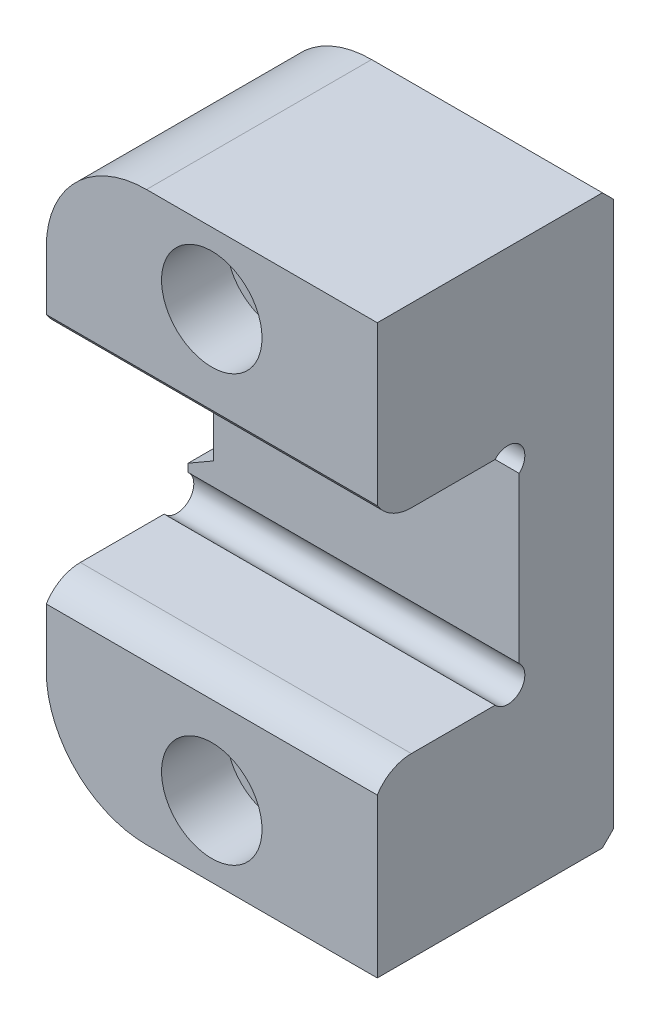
ISO-10303-21;
HEADER;
FILE_DESCRIPTION(('STEP AP214'),'2;1');
FILE_NAME('part.step','',(''),(''),'','','');
FILE_SCHEMA(('AUTOMOTIVE_DESIGN { 1 0 10303 214 1 1 1 1 }'));
ENDSEC;
DATA;
#1=APPLICATION_CONTEXT('core data for automotive mechanical design processes');
#2=APPLICATION_PROTOCOL_DEFINITION('international standard','automotive_design',2000,#1);
#3=PRODUCT_CONTEXT('',#1,'mechanical');
#4=PRODUCT('Part','Part','',(#3));
#5=PRODUCT_RELATED_PRODUCT_CATEGORY('part','',(#4));
#6=PRODUCT_DEFINITION_FORMATION('','',#4);
#7=PRODUCT_DEFINITION_CONTEXT('part definition',#1,'design');
#8=PRODUCT_DEFINITION('design','',#6,#7);
#9=PRODUCT_DEFINITION_SHAPE('','',#8);
#10=(LENGTH_UNIT() NAMED_UNIT(*) SI_UNIT(.MILLI.,.METRE.));
#11=(NAMED_UNIT(*) PLANE_ANGLE_UNIT() SI_UNIT($,.RADIAN.));
#12=(NAMED_UNIT(*) SI_UNIT($,.STERADIAN.) SOLID_ANGLE_UNIT());
#13=UNCERTAINTY_MEASURE_WITH_UNIT(LENGTH_MEASURE(1.E-05),#10,'distance_accuracy_value','');
#14=(GEOMETRIC_REPRESENTATION_CONTEXT(3) GLOBAL_UNCERTAINTY_ASSIGNED_CONTEXT((#13)) GLOBAL_UNIT_ASSIGNED_CONTEXT((#10,
#11,#12)) REPRESENTATION_CONTEXT('',''));
#15=CARTESIAN_POINT('',(0.,0.,0.));
#16=DIRECTION('',(0.,0.,1.));
#17=DIRECTION('',(1.,0.,0.));
#18=AXIS2_PLACEMENT_3D('',#15,#16,#17);
#19=CARTESIAN_POINT('',(22.225,14.2875,-19.05));
#20=DIRECTION('',(0.,0.,-1.));
#21=DIRECTION('',(-1.,0.,0.));
#22=AXIS2_PLACEMENT_3D('',#19,#20,#21);
#23=PLANE('',#22);
#24=DIRECTION('',(-0.866025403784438,0.500000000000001,0.));
#25=VECTOR('',#24,1.);
#26=CARTESIAN_POINT('',(9.24871450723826,-8.18808576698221,-19.05));
#27=LINE('',#26,#25);
#28=CARTESIAN_POINT('',(-18.8228635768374,8.01904739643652,-19.05));
#29=VERTEX_POINT('',#28);
#30=CARTESIAN_POINT('',(-22.225,9.98327177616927,-19.05));
#31=VERTEX_POINT('',#30);
#32=EDGE_CURVE('E340',#29,#31,#27,.T.);
#33=ORIENTED_EDGE('',*,*,#32,.F.);
#34=DIRECTION('',(0.,-1.,0.));
#35=VECTOR('',#34,1.);
#36=CARTESIAN_POINT('',(-18.8228635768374,-8.60845644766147,-19.05));
#37=LINE('',#36,#35);
#38=CARTESIAN_POINT('',(-18.8228635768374,-8.01904739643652,-19.05));
#39=VERTEX_POINT('',#38);
#40=EDGE_CURVE('E255',#29,#39,#37,.T.);
#41=ORIENTED_EDGE('',*,*,#40,.T.);
#42=DIRECTION('',(0.866025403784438,0.500000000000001,0.));
#43=VECTOR('',#42,1.);
#44=CARTESIAN_POINT('',(21.6220524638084,15.3318357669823,-19.05));
#45=LINE('',#44,#43);
#46=CARTESIAN_POINT('',(-22.225,-9.98327177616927,-19.05));
#47=VERTEX_POINT('',#46);
#48=EDGE_CURVE('E338',#47,#39,#45,.T.);
#49=ORIENTED_EDGE('',*,*,#48,.F.);
#50=DIRECTION('',(0.,-1.,0.));
#51=VECTOR('',#50,1.);
#52=CARTESIAN_POINT('',(-22.225,14.2875,-19.05));
#53=LINE('',#52,#51);
#54=CARTESIAN_POINT('',(-22.225,-11.0596162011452,-19.05));
#55=VERTEX_POINT('',#54);
#56=EDGE_CURVE('E221',#47,#55,#53,.T.);
#57=ORIENTED_EDGE('',*,*,#56,.T.);
#58=DIRECTION('',(1.,0.,0.));
#59=VECTOR('',#58,1.);
#60=CARTESIAN_POINT('',(-22.225,-11.0596162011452,-19.05));
#61=LINE('',#60,#59);
#62=CARTESIAN_POINT('',(22.225,-11.0596162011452,-19.05));
#63=VERTEX_POINT('',#62);
#64=EDGE_CURVE('E194',#55,#63,#61,.T.);
#65=ORIENTED_EDGE('',*,*,#64,.T.);
#66=DIRECTION('',(0.,-1.,0.));
#67=VECTOR('',#66,1.);
#68=CARTESIAN_POINT('',(22.225,14.2875,-19.05));
#69=LINE('',#68,#67);
#70=CARTESIAN_POINT('',(22.225,11.0596162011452,-19.05));
#71=VERTEX_POINT('',#70);
#72=EDGE_CURVE('E348',#71,#63,#69,.T.);
#73=ORIENTED_EDGE('',*,*,#72,.F.);
#74=DIRECTION('',(1.,0.,0.));
#75=VECTOR('',#74,1.);
#76=CARTESIAN_POINT('',(-22.225,11.0596162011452,-19.05));
#77=LINE('',#76,#75);
#78=CARTESIAN_POINT('',(-22.225,11.0596162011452,-19.05));
#79=VERTEX_POINT('',#78);
#80=EDGE_CURVE('E416',#71,#79,#77,.F.);
#81=ORIENTED_EDGE('',*,*,#80,.T.);
#82=EDGE_CURVE('E215',#79,#31,#53,.T.);
#83=ORIENTED_EDGE('',*,*,#82,.T.);
#84=EDGE_LOOP('',(#33,#41,#49,#57,#65,#73,#81,#83));
#85=FACE_BOUND('',#84,.T.);
#86=ADVANCED_FACE('F32',(#85),#23,.F.);
#87=CARTESIAN_POINT('',(22.225,38.1,-31.75));
#88=DIRECTION('',(0.,0.,1.));
#89=DIRECTION('',(1.,0.,0.));
#90=AXIS2_PLACEMENT_3D('',#87,#88,#89);
#91=PLANE('',#90);
#92=CARTESIAN_POINT('',(0.,28.575,-31.75));
#93=DIRECTION('',(0.,0.,1.));
#94=DIRECTION('',(1.,0.,0.));
#95=AXIS2_PLACEMENT_3D('',#92,#93,#94);
#96=CIRCLE('',#95,4.36498999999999);
#97=CARTESIAN_POINT('',(4.36498999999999,28.575,-31.75));
#98=VERTEX_POINT('',#97);
#99=EDGE_CURVE('E723',#98,#98,#96,.T.);
#100=ORIENTED_EDGE('',*,*,#99,.T.);
#101=EDGE_LOOP('',(#100));
#102=FACE_BOUND('',#101,.T.);
#103=CARTESIAN_POINT('',(0.,-28.575,-31.75));
#104=DIRECTION('',(0.,0.,1.));
#105=DIRECTION('',(1.,0.,0.));
#106=AXIS2_PLACEMENT_3D('',#103,#104,#105);
#107=CIRCLE('',#106,4.36498999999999);
#108=CARTESIAN_POINT('',(4.36498999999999,-28.575,-31.75));
#109=VERTEX_POINT('',#108);
#110=EDGE_CURVE('E709',#109,#109,#107,.T.);
#111=ORIENTED_EDGE('',*,*,#110,.T.);
#112=EDGE_LOOP('',(#111));
#113=FACE_BOUND('',#112,.T.);
#114=CARTESIAN_POINT('',(-8.763,-24.638,-31.75));
#115=DIRECTION('',(0.,0.,1.));
#116=DIRECTION('',(1.,0.,0.));
#117=AXIS2_PLACEMENT_3D('',#114,#115,#116);
#118=CIRCLE('',#117,11.938);
#119=CARTESIAN_POINT('',(-8.763,-36.576,-31.75));
#120=VERTEX_POINT('',#119);
#121=CARTESIAN_POINT('',(-20.701,-24.638,-31.75));
#122=VERTEX_POINT('',#121);
#123=EDGE_CURVE('E271',#120,#122,#118,.F.);
#124=ORIENTED_EDGE('',*,*,#123,.T.);
#125=DIRECTION('',(0.,1.,0.));
#126=VECTOR('',#125,1.);
#127=CARTESIAN_POINT('',(-20.701,-9.98327177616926,-31.75));
#128=LINE('',#127,#126);
#129=CARTESIAN_POINT('',(-20.701,-9.10338996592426,-31.75));
#130=VERTEX_POINT('',#129);
#131=EDGE_CURVE('E273',#122,#130,#128,.T.);
#132=ORIENTED_EDGE('',*,*,#131,.T.);
#133=DIRECTION('',(0.866025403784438,0.500000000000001,0.));
#134=VECTOR('',#133,1.);
#135=CARTESIAN_POINT('',(-19.84375,-8.60845644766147,-31.75));
#136=LINE('',#135,#134);
#137=CARTESIAN_POINT('',(-19.84375,-8.60845644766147,-31.75));
#138=VERTEX_POINT('',#137);
#139=EDGE_CURVE('E324',#130,#138,#136,.T.);
#140=ORIENTED_EDGE('',*,*,#139,.T.);
#141=DIRECTION('',(0.,1.,0.));
#142=VECTOR('',#141,1.);
#143=CARTESIAN_POINT('',(-19.84375,8.60845644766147,-31.75));
#144=LINE('',#143,#142);
#145=CARTESIAN_POINT('',(-19.84375,8.60845644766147,-31.75));
#146=VERTEX_POINT('',#145);
#147=EDGE_CURVE('E323',#138,#146,#144,.T.);
#148=ORIENTED_EDGE('',*,*,#147,.T.);
#149=DIRECTION('',(-0.866025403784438,0.500000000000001,0.));
#150=VECTOR('',#149,1.);
#151=CARTESIAN_POINT('',(-19.84375,8.60845644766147,-31.75));
#152=LINE('',#151,#150);
#153=CARTESIAN_POINT('',(-20.701,9.10338996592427,-31.75));
#154=VERTEX_POINT('',#153);
#155=EDGE_CURVE('E317',#146,#154,#152,.T.);
#156=ORIENTED_EDGE('',*,*,#155,.T.);
#157=DIRECTION('',(0.,1.,0.));
#158=VECTOR('',#157,1.);
#159=CARTESIAN_POINT('',(-20.701,24.638,-31.75));
#160=LINE('',#159,#158);
#161=CARTESIAN_POINT('',(-20.701,24.638,-31.75));
#162=VERTEX_POINT('',#161);
#163=EDGE_CURVE('E265',#154,#162,#160,.T.);
#164=ORIENTED_EDGE('',*,*,#163,.T.);
#165=CARTESIAN_POINT('',(-8.763,24.638,-31.75));
#166=DIRECTION('',(0.,0.,1.));
#167=DIRECTION('',(1.,0.,0.));
#168=AXIS2_PLACEMENT_3D('',#165,#166,#167);
#169=CIRCLE('',#168,11.938);
#170=CARTESIAN_POINT('',(-8.763,36.576,-31.75));
#171=VERTEX_POINT('',#170);
#172=EDGE_CURVE('E263',#162,#171,#169,.F.);
#173=ORIENTED_EDGE('',*,*,#172,.T.);
#174=DIRECTION('',(1.,0.,0.));
#175=VECTOR('',#174,1.);
#176=CARTESIAN_POINT('',(22.225,36.576,-31.75));
#177=LINE('',#176,#175);
#178=CARTESIAN_POINT('',(22.225,36.576,-31.75));
#179=VERTEX_POINT('',#178);
#180=EDGE_CURVE('E267',#171,#179,#177,.T.);
#181=ORIENTED_EDGE('',*,*,#180,.T.);
#182=DIRECTION('',(0.,1.,0.));
#183=VECTOR('',#182,1.);
#184=CARTESIAN_POINT('',(22.225,38.1,-31.75));
#185=LINE('',#184,#183);
#186=CARTESIAN_POINT('',(22.225,-36.576,-31.75));
#187=VERTEX_POINT('',#186);
#188=EDGE_CURVE('E357',#187,#179,#185,.T.);
#189=ORIENTED_EDGE('',*,*,#188,.F.);
#190=DIRECTION('',(-1.,0.,0.));
#191=VECTOR('',#190,1.);
#192=CARTESIAN_POINT('',(22.225,-36.576,-31.75));
#193=LINE('',#192,#191);
#194=EDGE_CURVE('E269',#187,#120,#193,.T.);
#195=ORIENTED_EDGE('',*,*,#194,.T.);
#196=EDGE_LOOP('',(#124,#132,#140,#148,#156,#164,#173,#181,#189,#195));
#197=FACE_BOUND('',#196,.T.);
#198=ADVANCED_FACE('F321',(#102,#113,#197),#91,.F.);
#199=CARTESIAN_POINT('',(-22.225,-14.2875,0.));
#200=DIRECTION('',(-1.,0.,0.));
#201=DIRECTION('',(0.,0.,1.));
#202=AXIS2_PLACEMENT_3D('',#199,#200,#201);
#203=PLANE('',#202);
#204=DIRECTION('',(0.,0.,1.));
#205=VECTOR('',#204,1.);
#206=CARTESIAN_POINT('',(-22.225,24.638,-31.75));
#207=LINE('',#206,#205);
#208=CARTESIAN_POINT('',(-22.225,24.638,0.));
#209=VERTEX_POINT('',#208);
#210=CARTESIAN_POINT('',(-22.225,24.638,-30.226));
#211=VERTEX_POINT('',#210);
#212=EDGE_CURVE('E235',#209,#211,#207,.F.);
#213=ORIENTED_EDGE('',*,*,#212,.T.);
#214=DIRECTION('',(0.,-1.,0.));
#215=VECTOR('',#214,1.);
#216=CARTESIAN_POINT('',(-22.225,9.98327177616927,-30.226));
#217=LINE('',#216,#215);
#218=CARTESIAN_POINT('',(-22.225,9.98327177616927,-30.226));
#219=VERTEX_POINT('',#218);
#220=EDGE_CURVE('E49',#211,#219,#217,.T.);
#221=ORIENTED_EDGE('',*,*,#220,.T.);
#222=DIRECTION('',(0.,0.,1.));
#223=VECTOR('',#222,1.);
#224=CARTESIAN_POINT('',(-22.225,9.98327177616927,0.));
#225=LINE('',#224,#223);
#226=EDGE_CURVE('E247',#219,#31,#225,.T.);
#227=ORIENTED_EDGE('',*,*,#226,.T.);
#228=ORIENTED_EDGE('',*,*,#82,.F.);
#229=CARTESIAN_POINT('',(-22.225,12.7635,-17.526));
#230=DIRECTION('',(1.,0.,0.));
#231=DIRECTION('',(0.,0.,-1.));
#232=AXIS2_PLACEMENT_3D('',#229,#230,#231);
#233=CIRCLE('',#232,2.286);
#234=CARTESIAN_POINT('',(-22.225,14.2875,-15.8221162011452));
#235=VERTEX_POINT('',#234);
#236=EDGE_CURVE('E423',#79,#235,#233,.T.);
#237=ORIENTED_EDGE('',*,*,#236,.T.);
#238=DIRECTION('',(0.,0.,-1.));
#239=VECTOR('',#238,1.);
#240=CARTESIAN_POINT('',(-22.225,14.2875,0.));
#241=LINE('',#240,#239);
#242=CARTESIAN_POINT('',(-22.225,14.2875,-4.57199999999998));
#243=VERTEX_POINT('',#242);
#244=EDGE_CURVE('E362',#243,#235,#241,.T.);
#245=ORIENTED_EDGE('',*,*,#244,.F.);
#246=CARTESIAN_POINT('',(-22.225,19.6722999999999,-4.57199999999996));
#247=DIRECTION('',(-1.,0.,0.));
#248=DIRECTION('',(0.,0.,-1.));
#249=AXIS2_PLACEMENT_3D('',#246,#247,#248);
#250=CIRCLE('',#249,5.38479999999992);
#251=CARTESIAN_POINT('',(-22.225,16.8275,0.));
#252=VERTEX_POINT('',#251);
#253=EDGE_CURVE('E415',#243,#252,#250,.T.);
#254=ORIENTED_EDGE('',*,*,#253,.T.);
#255=DIRECTION('',(0.,-1.,0.));
#256=VECTOR('',#255,1.);
#257=CARTESIAN_POINT('',(-22.225,38.1,0.));
#258=LINE('',#257,#256);
#259=EDGE_CURVE('E342',#209,#252,#258,.T.);
#260=ORIENTED_EDGE('',*,*,#259,.F.);
#261=EDGE_LOOP('',(#213,#221,#227,#228,#237,#245,#254,#260));
#262=FACE_BOUND('',#261,.T.);
#263=ADVANCED_FACE('F459',(#262),#203,.T.);
#264=DIRECTION('',(0.,0.,-1.));
#265=VECTOR('',#264,1.);
#266=CARTESIAN_POINT('',(-22.225,-9.98327177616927,0.));
#267=LINE('',#266,#265);
#268=CARTESIAN_POINT('',(-22.225,-9.98327177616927,-30.226));
#269=VERTEX_POINT('',#268);
#270=EDGE_CURVE('E245',#47,#269,#267,.T.);
#271=ORIENTED_EDGE('',*,*,#270,.T.);
#272=DIRECTION('',(0.,-1.,0.));
#273=VECTOR('',#272,1.);
#274=CARTESIAN_POINT('',(-22.225,-24.638,-30.226));
#275=LINE('',#274,#273);
#276=CARTESIAN_POINT('',(-22.225,-24.638,-30.226));
#277=VERTEX_POINT('',#276);
#278=EDGE_CURVE('E278',#269,#277,#275,.T.);
#279=ORIENTED_EDGE('',*,*,#278,.T.);
#280=DIRECTION('',(0.,0.,-1.));
#281=VECTOR('',#280,1.);
#282=CARTESIAN_POINT('',(-22.225,-24.638,0.));
#283=LINE('',#282,#281);
#284=CARTESIAN_POINT('',(-22.225,-24.638,0.));
#285=VERTEX_POINT('',#284);
#286=EDGE_CURVE('E237',#277,#285,#283,.F.);
#287=ORIENTED_EDGE('',*,*,#286,.T.);
#288=DIRECTION('',(0.,-1.,0.));
#289=VECTOR('',#288,1.);
#290=CARTESIAN_POINT('',(-22.225,-14.2875,0.));
#291=LINE('',#290,#289);
#292=CARTESIAN_POINT('',(-22.225,-16.8275,0.));
#293=VERTEX_POINT('',#292);
#294=EDGE_CURVE('E214',#293,#285,#291,.T.);
#295=ORIENTED_EDGE('',*,*,#294,.F.);
#296=CARTESIAN_POINT('',(-22.225,-19.6722999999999,-4.57199999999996));
#297=DIRECTION('',(-1.,0.,0.));
#298=DIRECTION('',(0.,0.,1.));
#299=AXIS2_PLACEMENT_3D('',#296,#297,#298);
#300=CIRCLE('',#299,5.38479999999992);
#301=CARTESIAN_POINT('',(-22.225,-14.2875,-4.57199999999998));
#302=VERTEX_POINT('',#301);
#303=EDGE_CURVE('E213',#293,#302,#300,.T.);
#304=ORIENTED_EDGE('',*,*,#303,.T.);
#305=DIRECTION('',(0.,0.,1.));
#306=VECTOR('',#305,1.);
#307=CARTESIAN_POINT('',(-22.225,-14.2875,-19.05));
#308=LINE('',#307,#306);
#309=CARTESIAN_POINT('',(-22.225,-14.2875,-15.8221162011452));
#310=VERTEX_POINT('',#309);
#311=EDGE_CURVE('E205',#310,#302,#308,.T.);
#312=ORIENTED_EDGE('',*,*,#311,.F.);
#313=CARTESIAN_POINT('',(-22.225,-12.7635,-17.526));
#314=DIRECTION('',(1.,0.,0.));
#315=DIRECTION('',(0.,0.,1.));
#316=AXIS2_PLACEMENT_3D('',#313,#314,#315);
#317=CIRCLE('',#316,2.286);
#318=EDGE_CURVE('E188',#310,#55,#317,.T.);
#319=ORIENTED_EDGE('',*,*,#318,.T.);
#320=ORIENTED_EDGE('',*,*,#56,.F.);
#321=EDGE_LOOP('',(#271,#279,#287,#295,#304,#312,#319,#320));
#322=FACE_BOUND('',#321,.T.);
#323=ADVANCED_FACE('F211',(#322),#203,.T.);
#324=CARTESIAN_POINT('',(22.225,38.1,0.));
#325=DIRECTION('',(0.,0.,-1.));
#326=DIRECTION('',(0.,1.,0.));
#327=AXIS2_PLACEMENT_3D('',#324,#325,#326);
#328=PLANE('',#327);
#329=CARTESIAN_POINT('',(0.,28.575,0.));
#330=DIRECTION('',(0.,0.,1.));
#331=DIRECTION('',(1.,0.,0.));
#332=AXIS2_PLACEMENT_3D('',#329,#330,#331);
#333=CIRCLE('',#332,6.74751);
#334=CARTESIAN_POINT('',(6.74751,28.575,0.));
#335=VERTEX_POINT('',#334);
#336=EDGE_CURVE('E298',#335,#335,#333,.T.);
#337=ORIENTED_EDGE('',*,*,#336,.F.);
#338=EDGE_LOOP('',(#337));
#339=FACE_BOUND('',#338,.T.);
#340=ORIENTED_EDGE('',*,*,#259,.T.);
#341=DIRECTION('',(1.,0.,0.));
#342=VECTOR('',#341,1.);
#343=CARTESIAN_POINT('',(-22.225,16.8275,0.));
#344=LINE('',#343,#342);
#345=CARTESIAN_POINT('',(22.225,16.8275,0.));
#346=VERTEX_POINT('',#345);
#347=EDGE_CURVE('E410',#252,#346,#344,.T.);
#348=ORIENTED_EDGE('',*,*,#347,.T.);
#349=DIRECTION('',(0.,-1.,0.));
#350=VECTOR('',#349,1.);
#351=CARTESIAN_POINT('',(22.225,38.1,0.));
#352=LINE('',#351,#350);
#353=CARTESIAN_POINT('',(22.225,38.1,0.));
#354=VERTEX_POINT('',#353);
#355=EDGE_CURVE('E218',#354,#346,#352,.T.);
#356=ORIENTED_EDGE('',*,*,#355,.F.);
#357=DIRECTION('',(-1.,0.,0.));
#358=VECTOR('',#357,1.);
#359=CARTESIAN_POINT('',(22.225,38.1,0.));
#360=LINE('',#359,#358);
#361=CARTESIAN_POINT('',(-8.763,38.1,0.));
#362=VERTEX_POINT('',#361);
#363=EDGE_CURVE('E225',#354,#362,#360,.T.);
#364=ORIENTED_EDGE('',*,*,#363,.T.);
#365=CARTESIAN_POINT('',(-8.763,24.638,0.));
#366=DIRECTION('',(0.,0.,-1.));
#367=DIRECTION('',(0.,1.,0.));
#368=AXIS2_PLACEMENT_3D('',#365,#366,#367);
#369=CIRCLE('',#368,13.462);
#370=EDGE_CURVE('E243',#362,#209,#369,.F.);
#371=ORIENTED_EDGE('',*,*,#370,.T.);
#372=EDGE_LOOP('',(#340,#348,#356,#364,#371));
#373=FACE_BOUND('',#372,.T.);
#374=ADVANCED_FACE('F409',(#339,#373),#328,.F.);
#375=CARTESIAN_POINT('',(22.225,14.2875,0.));
#376=DIRECTION('',(0.,1.,0.));
#377=DIRECTION('',(0.,0.,1.));
#378=AXIS2_PLACEMENT_3D('',#375,#376,#377);
#379=PLANE('',#378);
#380=ORIENTED_EDGE('',*,*,#244,.T.);
#381=DIRECTION('',(1.,0.,0.));
#382=VECTOR('',#381,1.);
#383=CARTESIAN_POINT('',(-22.225,14.2875,-15.8221162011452));
#384=LINE('',#383,#382);
#385=CARTESIAN_POINT('',(22.225,14.2875,-15.8221162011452));
#386=VERTEX_POINT('',#385);
#387=EDGE_CURVE('E420',#235,#386,#384,.T.);
#388=ORIENTED_EDGE('',*,*,#387,.T.);
#389=DIRECTION('',(0.,0.,-1.));
#390=VECTOR('',#389,1.);
#391=CARTESIAN_POINT('',(22.225,14.2875,0.));
#392=LINE('',#391,#390);
#393=CARTESIAN_POINT('',(22.225,14.2875,-4.57199999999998));
#394=VERTEX_POINT('',#393);
#395=EDGE_CURVE('E345',#394,#386,#392,.T.);
#396=ORIENTED_EDGE('',*,*,#395,.F.);
#397=DIRECTION('',(1.,0.,0.));
#398=VECTOR('',#397,1.);
#399=CARTESIAN_POINT('',(-22.225,14.2875,-4.57199999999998));
#400=LINE('',#399,#398);
#401=EDGE_CURVE('E419',#243,#394,#400,.T.);
#402=ORIENTED_EDGE('',*,*,#401,.F.);
#403=EDGE_LOOP('',(#380,#388,#396,#402));
#404=FACE_BOUND('',#403,.T.);
#405=ADVANCED_FACE('F418',(#404),#379,.F.);
#406=CARTESIAN_POINT('',(22.225,-14.2875,-19.05));
#407=DIRECTION('',(0.,-1.,0.));
#408=DIRECTION('',(0.,0.,-1.));
#409=AXIS2_PLACEMENT_3D('',#406,#407,#408);
#410=PLANE('',#409);
#411=DIRECTION('',(0.,0.,1.));
#412=VECTOR('',#411,1.);
#413=CARTESIAN_POINT('',(22.225,-14.2875,-19.05));
#414=LINE('',#413,#412);
#415=CARTESIAN_POINT('',(22.225,-14.2875,-15.8221162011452));
#416=VERTEX_POINT('',#415);
#417=CARTESIAN_POINT('',(22.225,-14.2875,-4.57199999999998));
#418=VERTEX_POINT('',#417);
#419=EDGE_CURVE('E207',#416,#418,#414,.T.);
#420=ORIENTED_EDGE('',*,*,#419,.F.);
#421=DIRECTION('',(1.,0.,0.));
#422=VECTOR('',#421,1.);
#423=CARTESIAN_POINT('',(-22.225,-14.2875,-15.8221162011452));
#424=LINE('',#423,#422);
#425=EDGE_CURVE('E191',#416,#310,#424,.F.);
#426=ORIENTED_EDGE('',*,*,#425,.T.);
#427=ORIENTED_EDGE('',*,*,#311,.T.);
#428=DIRECTION('',(1.,0.,0.));
#429=VECTOR('',#428,1.);
#430=CARTESIAN_POINT('',(-22.225,-14.2875,-4.57199999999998));
#431=LINE('',#430,#429);
#432=EDGE_CURVE('E328',#302,#418,#431,.T.);
#433=ORIENTED_EDGE('',*,*,#432,.T.);
#434=EDGE_LOOP('',(#420,#426,#427,#433));
#435=FACE_BOUND('',#434,.T.);
#436=ADVANCED_FACE('F203',(#435),#410,.F.);
#437=CARTESIAN_POINT('',(22.225,-14.2875,0.));
#438=DIRECTION('',(0.,0.,-1.));
#439=DIRECTION('',(0.,1.,0.));
#440=AXIS2_PLACEMENT_3D('',#437,#438,#439);
#441=PLANE('',#440);
#442=CARTESIAN_POINT('',(0.,-28.575,0.));
#443=DIRECTION('',(0.,0.,1.));
#444=DIRECTION('',(1.,0.,0.));
#445=AXIS2_PLACEMENT_3D('',#442,#443,#444);
#446=CIRCLE('',#445,6.74751);
#447=CARTESIAN_POINT('',(6.74751,-28.575,0.));
#448=VERTEX_POINT('',#447);
#449=EDGE_CURVE('E720',#448,#448,#446,.T.);
#450=ORIENTED_EDGE('',*,*,#449,.F.);
#451=EDGE_LOOP('',(#450));
#452=FACE_BOUND('',#451,.T.);
#453=DIRECTION('',(0.,-1.,0.));
#454=VECTOR('',#453,1.);
#455=CARTESIAN_POINT('',(22.225,-14.2875,0.));
#456=LINE('',#455,#454);
#457=CARTESIAN_POINT('',(22.225,-16.8275,0.));
#458=VERTEX_POINT('',#457);
#459=CARTESIAN_POINT('',(22.225,-38.1,0.));
#460=VERTEX_POINT('',#459);
#461=EDGE_CURVE('E352',#458,#460,#456,.T.);
#462=ORIENTED_EDGE('',*,*,#461,.F.);
#463=DIRECTION('',(1.,0.,0.));
#464=VECTOR('',#463,1.);
#465=CARTESIAN_POINT('',(-22.225,-16.8275,0.));
#466=LINE('',#465,#464);
#467=EDGE_CURVE('E325',#293,#458,#466,.T.);
#468=ORIENTED_EDGE('',*,*,#467,.F.);
#469=ORIENTED_EDGE('',*,*,#294,.T.);
#470=CARTESIAN_POINT('',(-8.763,-24.638,0.));
#471=DIRECTION('',(0.,0.,-1.));
#472=DIRECTION('',(0.,1.,0.));
#473=AXIS2_PLACEMENT_3D('',#470,#471,#472);
#474=CIRCLE('',#473,13.462);
#475=CARTESIAN_POINT('',(-8.763,-38.1,0.));
#476=VERTEX_POINT('',#475);
#477=EDGE_CURVE('E239',#285,#476,#474,.F.);
#478=ORIENTED_EDGE('',*,*,#477,.T.);
#479=DIRECTION('',(-1.,0.,0.));
#480=VECTOR('',#479,1.);
#481=CARTESIAN_POINT('',(22.225,-38.1,0.));
#482=LINE('',#481,#480);
#483=EDGE_CURVE('E228',#460,#476,#482,.T.);
#484=ORIENTED_EDGE('',*,*,#483,.F.);
#485=EDGE_LOOP('',(#462,#468,#469,#478,#484));
#486=FACE_BOUND('',#485,.T.);
#487=ADVANCED_FACE('F443',(#452,#486),#441,.F.);
#488=CARTESIAN_POINT('',(22.225,-38.1,0.));
#489=DIRECTION('',(0.,1.,0.));
#490=DIRECTION('',(0.,0.,1.));
#491=AXIS2_PLACEMENT_3D('',#488,#489,#490);
#492=PLANE('',#491);
#493=DIRECTION('',(0.,0.,-1.));
#494=VECTOR('',#493,1.);
#495=CARTESIAN_POINT('',(-8.763,-38.1,-31.75));
#496=LINE('',#495,#494);
#497=CARTESIAN_POINT('',(-8.763,-38.1,-30.226));
#498=VERTEX_POINT('',#497);
#499=EDGE_CURVE('E232',#476,#498,#496,.T.);
#500=ORIENTED_EDGE('',*,*,#499,.T.);
#501=DIRECTION('',(1.,0.,0.));
#502=VECTOR('',#501,1.);
#503=CARTESIAN_POINT('',(22.225,-38.1,-30.226));
#504=LINE('',#503,#502);
#505=CARTESIAN_POINT('',(22.225,-38.1,-30.226));
#506=VERTEX_POINT('',#505);
#507=EDGE_CURVE('E282',#498,#506,#504,.T.);
#508=ORIENTED_EDGE('',*,*,#507,.T.);
#509=DIRECTION('',(0.,0.,-1.));
#510=VECTOR('',#509,1.);
#511=CARTESIAN_POINT('',(22.225,-38.1,0.));
#512=LINE('',#511,#510);
#513=EDGE_CURVE('E354',#460,#506,#512,.T.);
#514=ORIENTED_EDGE('',*,*,#513,.F.);
#515=ORIENTED_EDGE('',*,*,#483,.T.);
#516=EDGE_LOOP('',(#500,#508,#514,#515));
#517=FACE_BOUND('',#516,.T.);
#518=ADVANCED_FACE('F389',(#517),#492,.F.);
#519=CARTESIAN_POINT('',(22.225,38.1,0.));
#520=DIRECTION('',(0.,-1.,0.));
#521=DIRECTION('',(0.,0.,-1.));
#522=AXIS2_PLACEMENT_3D('',#519,#520,#521);
#523=PLANE('',#522);
#524=DIRECTION('',(0.,0.,1.));
#525=VECTOR('',#524,1.);
#526=CARTESIAN_POINT('',(22.225,38.1,0.));
#527=LINE('',#526,#525);
#528=CARTESIAN_POINT('',(22.225,38.1,-30.226));
#529=VERTEX_POINT('',#528);
#530=EDGE_CURVE('E229',#529,#354,#527,.T.);
#531=ORIENTED_EDGE('',*,*,#530,.F.);
#532=DIRECTION('',(-1.,0.,0.));
#533=VECTOR('',#532,1.);
#534=CARTESIAN_POINT('',(22.225,38.1,-30.226));
#535=LINE('',#534,#533);
#536=CARTESIAN_POINT('',(-8.763,38.1,-30.226));
#537=VERTEX_POINT('',#536);
#538=EDGE_CURVE('E288',#529,#537,#535,.T.);
#539=ORIENTED_EDGE('',*,*,#538,.T.);
#540=DIRECTION('',(0.,0.,1.));
#541=VECTOR('',#540,1.);
#542=CARTESIAN_POINT('',(-8.763,38.1,0.));
#543=LINE('',#542,#541);
#544=EDGE_CURVE('E241',#537,#362,#543,.T.);
#545=ORIENTED_EDGE('',*,*,#544,.T.);
#546=ORIENTED_EDGE('',*,*,#363,.F.);
#547=EDGE_LOOP('',(#531,#539,#545,#546));
#548=FACE_BOUND('',#547,.T.);
#549=ADVANCED_FACE('F404',(#548),#523,.F.);
#550=CARTESIAN_POINT('',(22.225,-14.2875,0.));
#551=DIRECTION('',(-1.,0.,0.));
#552=DIRECTION('',(0.,0.,1.));
#553=AXIS2_PLACEMENT_3D('',#550,#551,#552);
#554=PLANE('',#553);
#555=ORIENTED_EDGE('',*,*,#513,.T.);
#556=DIRECTION('',(0.,-0.707106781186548,0.707106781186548));
#557=VECTOR('',#556,1.);
#558=CARTESIAN_POINT('',(22.225,-36.576,-31.75));
#559=LINE('',#558,#557);
#560=EDGE_CURVE('E286',#506,#187,#559,.F.);
#561=ORIENTED_EDGE('',*,*,#560,.T.);
#562=ORIENTED_EDGE('',*,*,#188,.T.);
#563=DIRECTION('',(0.,-0.707106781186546,-0.707106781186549));
#564=VECTOR('',#563,1.);
#565=CARTESIAN_POINT('',(22.225,38.1,-30.226));
#566=LINE('',#565,#564);
#567=EDGE_CURVE('E284',#179,#529,#566,.F.);
#568=ORIENTED_EDGE('',*,*,#567,.T.);
#569=ORIENTED_EDGE('',*,*,#530,.T.);
#570=ORIENTED_EDGE('',*,*,#355,.T.);
#571=CARTESIAN_POINT('',(22.225,19.6722999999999,-4.57199999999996));
#572=DIRECTION('',(-1.,0.,0.));
#573=DIRECTION('',(0.,0.,-1.));
#574=AXIS2_PLACEMENT_3D('',#571,#572,#573);
#575=CIRCLE('',#574,5.38479999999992);
#576=EDGE_CURVE('E412',#394,#346,#575,.T.);
#577=ORIENTED_EDGE('',*,*,#576,.F.);
#578=ORIENTED_EDGE('',*,*,#395,.T.);
#579=CARTESIAN_POINT('',(22.225,12.7635,-17.526));
#580=DIRECTION('',(-1.,0.,0.));
#581=DIRECTION('',(0.,0.,1.));
#582=AXIS2_PLACEMENT_3D('',#579,#580,#581);
#583=CIRCLE('',#582,2.286);
#584=EDGE_CURVE('E249',#386,#71,#583,.T.);
#585=ORIENTED_EDGE('',*,*,#584,.T.);
#586=ORIENTED_EDGE('',*,*,#72,.T.);
#587=CARTESIAN_POINT('',(22.225,-12.7635,-17.526));
#588=DIRECTION('',(1.,0.,0.));
#589=DIRECTION('',(0.,0.,1.));
#590=AXIS2_PLACEMENT_3D('',#587,#588,#589);
#591=CIRCLE('',#590,2.286);
#592=EDGE_CURVE('E199',#416,#63,#591,.T.);
#593=ORIENTED_EDGE('',*,*,#592,.F.);
#594=ORIENTED_EDGE('',*,*,#419,.T.);
#595=CARTESIAN_POINT('',(22.225,-19.6722999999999,-4.57199999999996));
#596=DIRECTION('',(-1.,0.,0.));
#597=DIRECTION('',(0.,0.,1.));
#598=AXIS2_PLACEMENT_3D('',#595,#596,#597);
#599=CIRCLE('',#598,5.38479999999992);
#600=EDGE_CURVE('E433',#458,#418,#599,.T.);
#601=ORIENTED_EDGE('',*,*,#600,.F.);
#602=ORIENTED_EDGE('',*,*,#461,.T.);
#603=EDGE_LOOP('',(#555,#561,#562,#568,#569,#570,#577,#578,#585,#586,#593,#594,#601,#602));
#604=FACE_BOUND('',#603,.T.);
#605=ADVANCED_FACE('F398',(#604),#554,.F.);
#606=CARTESIAN_POINT('',(-8.763,-24.638,0.));
#607=DIRECTION('',(0.,0.,1.));
#608=DIRECTION('',(1.,0.,0.));
#609=AXIS2_PLACEMENT_3D('',#606,#607,#608);
#610=CYLINDRICAL_SURFACE('',#609,13.462);
#611=ORIENTED_EDGE('',*,*,#286,.F.);
#612=CARTESIAN_POINT('',(-8.763,-24.638,-30.226));
#613=DIRECTION('',(0.,0.,1.));
#614=DIRECTION('',(1.,0.,0.));
#615=AXIS2_PLACEMENT_3D('',#612,#613,#614);
#616=CIRCLE('',#615,13.462);
#617=EDGE_CURVE('E280',#277,#498,#616,.T.);
#618=ORIENTED_EDGE('',*,*,#617,.T.);
#619=ORIENTED_EDGE('',*,*,#499,.F.);
#620=ORIENTED_EDGE('',*,*,#477,.F.);
#621=EDGE_LOOP('',(#611,#618,#619,#620));
#622=FACE_BOUND('',#621,.T.);
#623=ADVANCED_FACE('F385',(#622),#610,.T.);
#624=CARTESIAN_POINT('',(-8.763,24.638,0.));
#625=DIRECTION('',(0.,0.,-1.));
#626=DIRECTION('',(-1.,0.,0.));
#627=AXIS2_PLACEMENT_3D('',#624,#625,#626);
#628=CYLINDRICAL_SURFACE('',#627,13.462);
#629=ORIENTED_EDGE('',*,*,#544,.F.);
#630=CARTESIAN_POINT('',(-8.763,24.638,-30.226));
#631=DIRECTION('',(0.,0.,1.));
#632=DIRECTION('',(1.,0.,0.));
#633=AXIS2_PLACEMENT_3D('',#630,#631,#632);
#634=CIRCLE('',#633,13.462);
#635=EDGE_CURVE('E11',#537,#211,#634,.T.);
#636=ORIENTED_EDGE('',*,*,#635,.T.);
#637=ORIENTED_EDGE('',*,*,#212,.F.);
#638=ORIENTED_EDGE('',*,*,#370,.F.);
#639=EDGE_LOOP('',(#629,#636,#637,#638));
#640=FACE_BOUND('',#639,.T.);
#641=ADVANCED_FACE('F470',(#640),#628,.T.);
#642=CARTESIAN_POINT('',(-19.84375,8.60845644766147,0.));
#643=DIRECTION('',(-1.,0.,0.));
#644=DIRECTION('',(0.,0.,1.));
#645=AXIS2_PLACEMENT_3D('',#642,#643,#644);
#646=PLANE('',#645);
#647=DIRECTION('',(0.,0.,-1.));
#648=VECTOR('',#647,1.);
#649=CARTESIAN_POINT('',(-19.84375,-8.60845644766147,0.));
#650=LINE('',#649,#648);
#651=CARTESIAN_POINT('',(-19.84375,-8.60845644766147,-22.8600000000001));
#652=VERTEX_POINT('',#651);
#653=EDGE_CURVE('E335',#652,#138,#650,.T.);
#654=ORIENTED_EDGE('',*,*,#653,.F.);
#655=DIRECTION('',(0.,1.,0.));
#656=VECTOR('',#655,1.);
#657=CARTESIAN_POINT('',(-19.84375,8.60845644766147,-22.8600000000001));
#658=LINE('',#657,#656);
#659=CARTESIAN_POINT('',(-19.84375,8.60845644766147,-22.8600000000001));
#660=VERTEX_POINT('',#659);
#661=EDGE_CURVE('E252',#652,#660,#658,.T.);
#662=ORIENTED_EDGE('',*,*,#661,.T.);
#663=DIRECTION('',(0.,0.,-1.));
#664=VECTOR('',#663,1.);
#665=CARTESIAN_POINT('',(-19.84375,8.60845644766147,0.));
#666=LINE('',#665,#664);
#667=EDGE_CURVE('E333',#660,#146,#666,.T.);
#668=ORIENTED_EDGE('',*,*,#667,.T.);
#669=ORIENTED_EDGE('',*,*,#147,.F.);
#670=EDGE_LOOP('',(#654,#662,#668,#669));
#671=FACE_BOUND('',#670,.T.);
#672=ADVANCED_FACE('F473',(#671),#646,.T.);
#673=CARTESIAN_POINT('',(-19.84375,8.60845644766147,0.));
#674=DIRECTION('',(-0.500000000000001,-0.866025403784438,0.));
#675=DIRECTION('',(0.866025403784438,-0.500000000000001,0.));
#676=AXIS2_PLACEMENT_3D('',#673,#674,#675);
#677=PLANE('',#676);
#678=ORIENTED_EDGE('',*,*,#226,.F.);
#679=DIRECTION('',(0.654653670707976,-0.377964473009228,-0.654653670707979));
#680=VECTOR('',#679,1.);
#681=CARTESIAN_POINT('',(-33.8182857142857,16.6766584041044,-18.6327142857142));
#682=LINE('',#681,#680);
#683=EDGE_CURVE('E41',#219,#154,#682,.T.);
#684=ORIENTED_EDGE('',*,*,#683,.T.);
#685=ORIENTED_EDGE('',*,*,#155,.F.);
#686=ORIENTED_EDGE('',*,*,#667,.F.);
#687=DIRECTION('',(0.25597695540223,-0.147788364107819,0.955319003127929));
#688=VECTOR('',#687,1.);
#689=CARTESIAN_POINT('',(-19.84375,8.60845644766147,-22.8600000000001));
#690=LINE('',#689,#688);
#691=EDGE_CURVE('E258',#660,#29,#690,.T.);
#692=ORIENTED_EDGE('',*,*,#691,.T.);
#693=ORIENTED_EDGE('',*,*,#32,.T.);
#694=EDGE_LOOP('',(#678,#684,#685,#686,#692,#693));
#695=FACE_BOUND('',#694,.T.);
#696=ADVANCED_FACE('F315',(#695),#677,.T.);
#697=CARTESIAN_POINT('',(-19.84375,-8.60845644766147,0.));
#698=DIRECTION('',(-0.500000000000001,0.866025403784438,0.));
#699=DIRECTION('',(-0.866025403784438,-0.500000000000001,0.));
#700=AXIS2_PLACEMENT_3D('',#697,#698,#699);
#701=PLANE('',#700);
#702=ORIENTED_EDGE('',*,*,#139,.F.);
#703=DIRECTION('',(-0.654653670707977,-0.377964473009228,0.654653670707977));
#704=VECTOR('',#703,1.);
#705=CARTESIAN_POINT('',(-33.8182857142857,-16.6766584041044,-18.6327142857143));
#706=LINE('',#705,#704);
#707=EDGE_CURVE('E276',#130,#269,#706,.T.);
#708=ORIENTED_EDGE('',*,*,#707,.T.);
#709=ORIENTED_EDGE('',*,*,#270,.F.);
#710=ORIENTED_EDGE('',*,*,#48,.T.);
#711=DIRECTION('',(-0.25597695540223,-0.147788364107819,-0.955319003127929));
#712=VECTOR('',#711,1.);
#713=CARTESIAN_POINT('',(-19.1924270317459,-8.23241495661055,-20.429229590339));
#714=LINE('',#713,#712);
#715=EDGE_CURVE('E261',#39,#652,#714,.T.);
#716=ORIENTED_EDGE('',*,*,#715,.T.);
#717=ORIENTED_EDGE('',*,*,#653,.T.);
#718=EDGE_LOOP('',(#702,#708,#709,#710,#716,#717));
#719=FACE_BOUND('',#718,.T.);
#720=ADVANCED_FACE('F587',(#719),#701,.T.);
#721=CARTESIAN_POINT('',(-22.225,-19.6722999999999,-4.57199999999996));
#722=DIRECTION('',(1.,0.,0.));
#723=DIRECTION('',(0.,0.,-1.));
#724=AXIS2_PLACEMENT_3D('',#721,#722,#723);
#725=CYLINDRICAL_SURFACE('',#724,5.38479999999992);
#726=ORIENTED_EDGE('',*,*,#600,.T.);
#727=ORIENTED_EDGE('',*,*,#432,.F.);
#728=ORIENTED_EDGE('',*,*,#303,.F.);
#729=ORIENTED_EDGE('',*,*,#467,.T.);
#730=EDGE_LOOP('',(#726,#727,#728,#729));
#731=FACE_BOUND('',#730,.T.);
#732=ADVANCED_FACE('F439',(#731),#725,.T.);
#733=CARTESIAN_POINT('',(-22.225,19.6722999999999,-4.57199999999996));
#734=DIRECTION('',(1.,0.,0.));
#735=DIRECTION('',(0.,0.,-1.));
#736=AXIS2_PLACEMENT_3D('',#733,#734,#735);
#737=CYLINDRICAL_SURFACE('',#736,5.38479999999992);
#738=ORIENTED_EDGE('',*,*,#576,.T.);
#739=ORIENTED_EDGE('',*,*,#347,.F.);
#740=ORIENTED_EDGE('',*,*,#253,.F.);
#741=ORIENTED_EDGE('',*,*,#401,.T.);
#742=EDGE_LOOP('',(#738,#739,#740,#741));
#743=FACE_BOUND('',#742,.T.);
#744=ADVANCED_FACE('F572',(#743),#737,.T.);
#745=CARTESIAN_POINT('',(-22.225,12.7635,-17.526));
#746=DIRECTION('',(1.,0.,0.));
#747=DIRECTION('',(0.,0.,-1.));
#748=AXIS2_PLACEMENT_3D('',#745,#746,#747);
#749=CYLINDRICAL_SURFACE('',#748,2.286);
#750=ORIENTED_EDGE('',*,*,#584,.F.);
#751=ORIENTED_EDGE('',*,*,#387,.F.);
#752=ORIENTED_EDGE('',*,*,#236,.F.);
#753=ORIENTED_EDGE('',*,*,#80,.F.);
#754=EDGE_LOOP('',(#750,#751,#752,#753));
#755=FACE_BOUND('',#754,.T.);
#756=ADVANCED_FACE('F564',(#755),#749,.F.);
#757=CARTESIAN_POINT('',(-22.225,-12.7635,-17.526));
#758=DIRECTION('',(1.,0.,0.));
#759=DIRECTION('',(0.,0.,-1.));
#760=AXIS2_PLACEMENT_3D('',#757,#758,#759);
#761=CYLINDRICAL_SURFACE('',#760,2.286);
#762=ORIENTED_EDGE('',*,*,#318,.F.);
#763=ORIENTED_EDGE('',*,*,#425,.F.);
#764=ORIENTED_EDGE('',*,*,#592,.T.);
#765=ORIENTED_EDGE('',*,*,#64,.F.);
#766=EDGE_LOOP('',(#762,#763,#764,#765));
#767=FACE_BOUND('',#766,.T.);
#768=ADVANCED_FACE('F190',(#767),#761,.F.);
#769=CARTESIAN_POINT('',(0.,-28.575,0.));
#770=DIRECTION('',(0.,0.,1.));
#771=DIRECTION('',(1.,0.,0.));
#772=AXIS2_PLACEMENT_3D('',#769,#770,#771);
#773=CYLINDRICAL_SURFACE('',#772,4.36499);
#774=ORIENTED_EDGE('',*,*,#110,.F.);
#775=EDGE_LOOP('',(#774));
#776=FACE_BOUND('',#775,.T.);
#777=CARTESIAN_POINT('',(0.,-28.575,-8.73125));
#778=DIRECTION('',(0.,0.,1.));
#779=DIRECTION('',(1.,0.,0.));
#780=AXIS2_PLACEMENT_3D('',#777,#778,#779);
#781=CIRCLE('',#780,4.36499);
#782=CARTESIAN_POINT('',(4.36499,-28.575,-8.73125));
#783=VERTEX_POINT('',#782);
#784=EDGE_CURVE('E712',#783,#783,#781,.T.);
#785=ORIENTED_EDGE('',*,*,#784,.T.);
#786=EDGE_LOOP('',(#785));
#787=FACE_BOUND('',#786,.T.);
#788=ADVANCED_FACE('F549',(#776,#787),#773,.F.);
#789=CARTESIAN_POINT('',(4.36499,-28.575,-8.73125));
#790=DIRECTION('',(0.,0.,-1.));
#791=DIRECTION('',(-1.,0.,0.));
#792=AXIS2_PLACEMENT_3D('',#789,#790,#791);
#793=PLANE('',#792);
#794=ORIENTED_EDGE('',*,*,#784,.F.);
#795=EDGE_LOOP('',(#794));
#796=FACE_BOUND('',#795,.T.);
#797=CARTESIAN_POINT('',(0.,-28.575,-8.73125));
#798=DIRECTION('',(0.,0.,1.));
#799=DIRECTION('',(1.,0.,0.));
#800=AXIS2_PLACEMENT_3D('',#797,#798,#799);
#801=CIRCLE('',#800,6.74751);
#802=CARTESIAN_POINT('',(6.74751,-28.575,-8.73125));
#803=VERTEX_POINT('',#802);
#804=EDGE_CURVE('E717',#803,#803,#801,.T.);
#805=ORIENTED_EDGE('',*,*,#804,.T.);
#806=EDGE_LOOP('',(#805));
#807=FACE_BOUND('',#806,.T.);
#808=ADVANCED_FACE('F541',(#796,#807),#793,.F.);
#809=CARTESIAN_POINT('',(0.,-28.575,0.));
#810=DIRECTION('',(0.,0.,1.));
#811=DIRECTION('',(1.,0.,0.));
#812=AXIS2_PLACEMENT_3D('',#809,#810,#811);
#813=CYLINDRICAL_SURFACE('',#812,6.74751);
#814=ORIENTED_EDGE('',*,*,#804,.F.);
#815=EDGE_LOOP('',(#814));
#816=FACE_BOUND('',#815,.T.);
#817=ORIENTED_EDGE('',*,*,#449,.T.);
#818=EDGE_LOOP('',(#817));
#819=FACE_BOUND('',#818,.T.);
#820=ADVANCED_FACE('F533',(#816,#819),#813,.F.);
#821=CARTESIAN_POINT('',(0.,28.575,0.));
#822=DIRECTION('',(0.,0.,1.));
#823=DIRECTION('',(1.,0.,0.));
#824=AXIS2_PLACEMENT_3D('',#821,#822,#823);
#825=CYLINDRICAL_SURFACE('',#824,4.36499);
#826=ORIENTED_EDGE('',*,*,#99,.F.);
#827=EDGE_LOOP('',(#826));
#828=FACE_BOUND('',#827,.T.);
#829=CARTESIAN_POINT('',(0.,28.575,-8.73125));
#830=DIRECTION('',(0.,0.,1.));
#831=DIRECTION('',(1.,0.,0.));
#832=AXIS2_PLACEMENT_3D('',#829,#830,#831);
#833=CIRCLE('',#832,4.36499);
#834=CARTESIAN_POINT('',(4.36499,28.575,-8.73125));
#835=VERTEX_POINT('',#834);
#836=EDGE_CURVE('E726',#835,#835,#833,.T.);
#837=ORIENTED_EDGE('',*,*,#836,.T.);
#838=EDGE_LOOP('',(#837));
#839=FACE_BOUND('',#838,.T.);
#840=ADVANCED_FACE('F525',(#828,#839),#825,.F.);
#841=CARTESIAN_POINT('',(4.36499,28.575,-8.73125));
#842=DIRECTION('',(0.,0.,-1.));
#843=DIRECTION('',(-1.,0.,0.));
#844=AXIS2_PLACEMENT_3D('',#841,#842,#843);
#845=PLANE('',#844);
#846=ORIENTED_EDGE('',*,*,#836,.F.);
#847=EDGE_LOOP('',(#846));
#848=FACE_BOUND('',#847,.T.);
#849=CARTESIAN_POINT('',(0.,28.575,-8.73125));
#850=DIRECTION('',(0.,0.,1.));
#851=DIRECTION('',(1.,0.,0.));
#852=AXIS2_PLACEMENT_3D('',#849,#850,#851);
#853=CIRCLE('',#852,6.74751);
#854=CARTESIAN_POINT('',(6.74751,28.575,-8.73125));
#855=VERTEX_POINT('',#854);
#856=EDGE_CURVE('E729',#855,#855,#853,.T.);
#857=ORIENTED_EDGE('',*,*,#856,.T.);
#858=EDGE_LOOP('',(#857));
#859=FACE_BOUND('',#858,.T.);
#860=ADVANCED_FACE('F517',(#848,#859),#845,.F.);
#861=CARTESIAN_POINT('',(0.,28.575,0.));
#862=DIRECTION('',(0.,0.,1.));
#863=DIRECTION('',(1.,0.,0.));
#864=AXIS2_PLACEMENT_3D('',#861,#862,#863);
#865=CYLINDRICAL_SURFACE('',#864,6.74751);
#866=ORIENTED_EDGE('',*,*,#856,.F.);
#867=EDGE_LOOP('',(#866));
#868=FACE_BOUND('',#867,.T.);
#869=ORIENTED_EDGE('',*,*,#336,.T.);
#870=EDGE_LOOP('',(#869));
#871=FACE_BOUND('',#870,.T.);
#872=ADVANCED_FACE('F477',(#868,#871),#865,.F.);
#873=CARTESIAN_POINT('',(-19.84375,8.60845644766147,-22.8600000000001));
#874=DIRECTION('',(-0.965925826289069,0.,0.258819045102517));
#875=DIRECTION('',(0.258819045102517,0.,0.965925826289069));
#876=AXIS2_PLACEMENT_3D('',#873,#874,#875);
#877=PLANE('',#876);
#878=ORIENTED_EDGE('',*,*,#715,.F.);
#879=ORIENTED_EDGE('',*,*,#40,.F.);
#880=ORIENTED_EDGE('',*,*,#691,.F.);
#881=ORIENTED_EDGE('',*,*,#661,.F.);
#882=EDGE_LOOP('',(#878,#879,#880,#881));
#883=FACE_BOUND('',#882,.T.);
#884=ADVANCED_FACE('F474',(#883),#877,.T.);
#885=CARTESIAN_POINT('',(22.225,-36.576,-31.75));
#886=DIRECTION('',(0.,0.707106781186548,0.707106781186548));
#887=DIRECTION('',(0.,-0.707106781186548,0.707106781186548));
#888=AXIS2_PLACEMENT_3D('',#885,#886,#887);
#889=PLANE('',#888);
#890=ORIENTED_EDGE('',*,*,#560,.F.);
#891=ORIENTED_EDGE('',*,*,#507,.F.);
#892=DIRECTION('',(0.,-0.707106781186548,0.707106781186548));
#893=VECTOR('',#892,1.);
#894=CARTESIAN_POINT('',(-8.763,-36.576,-31.75));
#895=LINE('',#894,#893);
#896=EDGE_CURVE('E296',#120,#498,#895,.T.);
#897=ORIENTED_EDGE('',*,*,#896,.F.);
#898=ORIENTED_EDGE('',*,*,#194,.F.);
#899=EDGE_LOOP('',(#890,#891,#897,#898));
#900=FACE_BOUND('',#899,.T.);
#901=ADVANCED_FACE('F394',(#900),#889,.F.);
#902=CARTESIAN_POINT('',(-8.763,-24.638,-31.75));
#903=DIRECTION('',(0.,0.,1.));
#904=DIRECTION('',(1.,0.,0.));
#905=AXIS2_PLACEMENT_3D('',#902,#903,#904);
#906=CONICAL_SURFACE('',#905,11.938,0.785398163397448);
#907=ORIENTED_EDGE('',*,*,#896,.T.);
#908=ORIENTED_EDGE('',*,*,#617,.F.);
#909=DIRECTION('',(-0.707106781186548,0.,0.707106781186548));
#910=VECTOR('',#909,1.);
#911=CARTESIAN_POINT('',(-20.701,-24.638,-31.75));
#912=LINE('',#911,#910);
#913=EDGE_CURVE('E293',#122,#277,#912,.T.);
#914=ORIENTED_EDGE('',*,*,#913,.F.);
#915=ORIENTED_EDGE('',*,*,#123,.F.);
#916=EDGE_LOOP('',(#907,#908,#914,#915));
#917=FACE_BOUND('',#916,.T.);
#918=ADVANCED_FACE('F381',(#917),#906,.T.);
#919=CARTESIAN_POINT('',(-20.701,38.1,-31.75));
#920=DIRECTION('',(-0.707106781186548,0.,-0.707106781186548));
#921=DIRECTION('',(-0.707106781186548,0.,0.707106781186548));
#922=AXIS2_PLACEMENT_3D('',#919,#920,#921);
#923=PLANE('',#922);
#924=ORIENTED_EDGE('',*,*,#913,.T.);
#925=ORIENTED_EDGE('',*,*,#278,.F.);
#926=ORIENTED_EDGE('',*,*,#707,.F.);
#927=ORIENTED_EDGE('',*,*,#131,.F.);
#928=EDGE_LOOP('',(#924,#925,#926,#927));
#929=FACE_BOUND('',#928,.T.);
#930=ADVANCED_FACE('F375',(#929),#923,.T.);
#931=CARTESIAN_POINT('',(-20.701,38.1,-31.75));
#932=DIRECTION('',(-0.707106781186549,0.,-0.707106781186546));
#933=DIRECTION('',(-0.707106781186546,0.,0.707106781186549));
#934=AXIS2_PLACEMENT_3D('',#931,#932,#933);
#935=PLANE('',#934);
#936=ORIENTED_EDGE('',*,*,#683,.F.);
#937=ORIENTED_EDGE('',*,*,#220,.F.);
#938=DIRECTION('',(-0.707106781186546,0.,0.707106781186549));
#939=VECTOR('',#938,1.);
#940=CARTESIAN_POINT('',(-20.701,24.638,-31.75));
#941=LINE('',#940,#939);
#942=EDGE_CURVE('E36',#162,#211,#941,.T.);
#943=ORIENTED_EDGE('',*,*,#942,.F.);
#944=ORIENTED_EDGE('',*,*,#163,.F.);
#945=EDGE_LOOP('',(#936,#937,#943,#944));
#946=FACE_BOUND('',#945,.T.);
#947=ADVANCED_FACE('F34',(#946),#935,.T.);
#948=CARTESIAN_POINT('',(-8.763,24.638,-31.75));
#949=DIRECTION('',(0.,0.,1.));
#950=DIRECTION('',(1.,0.,0.));
#951=AXIS2_PLACEMENT_3D('',#948,#949,#950);
#952=CONICAL_SURFACE('',#951,11.938,0.785398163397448);
#953=ORIENTED_EDGE('',*,*,#942,.T.);
#954=ORIENTED_EDGE('',*,*,#635,.F.);
#955=DIRECTION('',(0.,0.707106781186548,0.707106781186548));
#956=VECTOR('',#955,1.);
#957=CARTESIAN_POINT('',(-8.763,36.576,-31.75));
#958=LINE('',#957,#956);
#959=EDGE_CURVE('E299',#171,#537,#958,.T.);
#960=ORIENTED_EDGE('',*,*,#959,.F.);
#961=ORIENTED_EDGE('',*,*,#172,.F.);
#962=EDGE_LOOP('',(#953,#954,#960,#961));
#963=FACE_BOUND('',#962,.T.);
#964=ADVANCED_FACE('F308',(#963),#952,.T.);
#965=CARTESIAN_POINT('',(22.225,38.1,-30.226));
#966=DIRECTION('',(0.,-0.707106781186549,0.707106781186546));
#967=DIRECTION('',(0.,-0.707106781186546,-0.707106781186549));
#968=AXIS2_PLACEMENT_3D('',#965,#966,#967);
#969=PLANE('',#968);
#970=ORIENTED_EDGE('',*,*,#567,.F.);
#971=ORIENTED_EDGE('',*,*,#180,.F.);
#972=ORIENTED_EDGE('',*,*,#959,.T.);
#973=ORIENTED_EDGE('',*,*,#538,.F.);
#974=EDGE_LOOP('',(#970,#971,#972,#973));
#975=FACE_BOUND('',#974,.T.);
#976=ADVANCED_FACE('F400',(#975),#969,.F.);
#977=CLOSED_SHELL('',(#86,#198,#263,#323,#374,#405,#436,#487,#518,#549,#605,#623,#641,#672,#696,
#720,#732,#744,#756,#768,#788,#808,#820,#840,#860,#872,#884,#901,#918,#930,#947,#964,#976));
#978=MANIFOLD_SOLID_BREP('B2',#977);
#979=ADVANCED_BREP_SHAPE_REPRESENTATION('',(#18,#978),#14);
#980=SHAPE_DEFINITION_REPRESENTATION(#9,#979);
ENDSEC;
END-ISO-10303-21;
